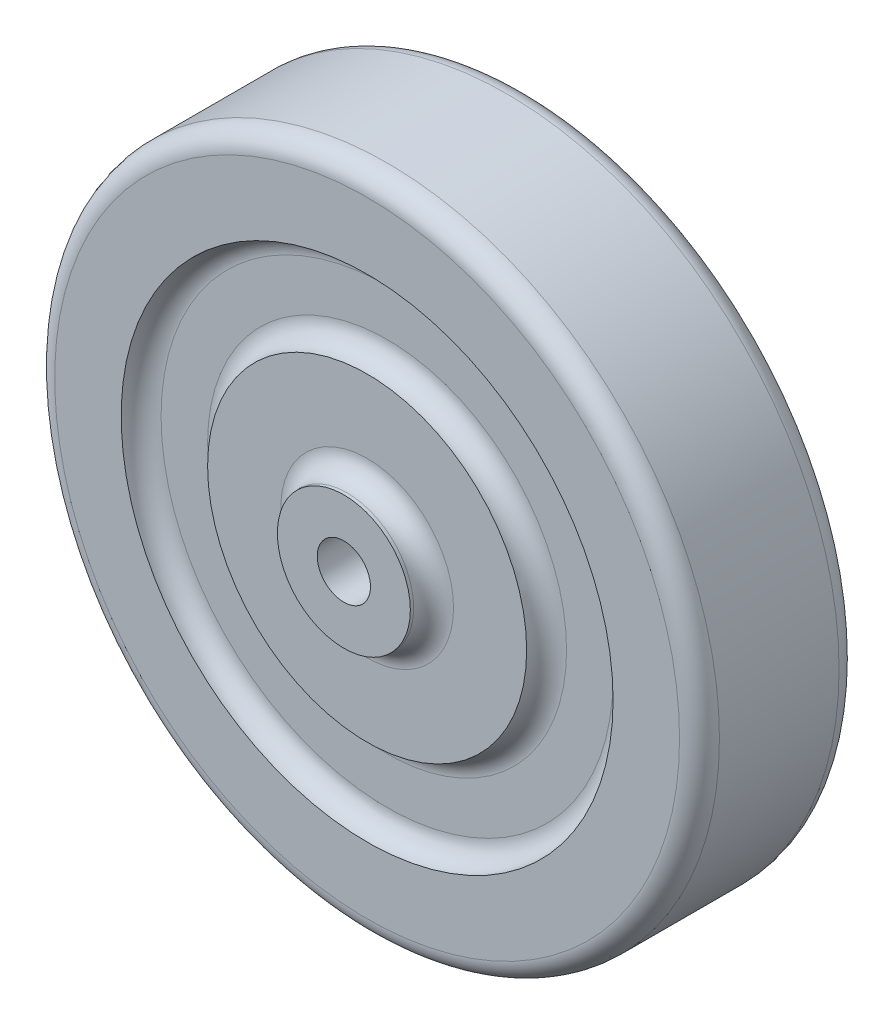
ISO-10303-21;
HEADER;
FILE_DESCRIPTION(('STEP AP214'),'2;1');
FILE_NAME('part.step','',(''),(''),'','','');
FILE_SCHEMA(('AUTOMOTIVE_DESIGN { 1 0 10303 214 1 1 1 1 }'));
ENDSEC;
DATA;
#1=APPLICATION_CONTEXT('core data for automotive mechanical design processes');
#2=APPLICATION_PROTOCOL_DEFINITION('international standard','automotive_design',2000,#1);
#3=PRODUCT_CONTEXT('',#1,'mechanical');
#4=PRODUCT('Part','Part','',(#3));
#5=PRODUCT_RELATED_PRODUCT_CATEGORY('part','',(#4));
#6=PRODUCT_DEFINITION_FORMATION('','',#4);
#7=PRODUCT_DEFINITION_CONTEXT('part definition',#1,'design');
#8=PRODUCT_DEFINITION('design','',#6,#7);
#9=PRODUCT_DEFINITION_SHAPE('','',#8);
#10=(LENGTH_UNIT() NAMED_UNIT(*) SI_UNIT(.MILLI.,.METRE.));
#11=(NAMED_UNIT(*) PLANE_ANGLE_UNIT() SI_UNIT($,.RADIAN.));
#12=(NAMED_UNIT(*) SI_UNIT($,.STERADIAN.) SOLID_ANGLE_UNIT());
#13=UNCERTAINTY_MEASURE_WITH_UNIT(LENGTH_MEASURE(1.E-05),#10,'distance_accuracy_value','');
#14=(GEOMETRIC_REPRESENTATION_CONTEXT(3) GLOBAL_UNCERTAINTY_ASSIGNED_CONTEXT((#13)) GLOBAL_UNIT_ASSIGNED_CONTEXT((#10,
#11,#12)) REPRESENTATION_CONTEXT('',''));
#15=CARTESIAN_POINT('',(0.,0.,0.));
#16=DIRECTION('',(0.,0.,1.));
#17=DIRECTION('',(1.,0.,0.));
#18=AXIS2_PLACEMENT_3D('',#15,#16,#17);
#19=CARTESIAN_POINT('',(0.,0.,-12.));
#20=DIRECTION('',(0.,0.,1.));
#21=DIRECTION('',(1.,0.,0.));
#22=AXIS2_PLACEMENT_3D('',#19,#20,#21);
#23=PLANE('',#22);
#24=CARTESIAN_POINT('',(0.,0.,-12.));
#25=DIRECTION('',(0.,0.,1.));
#26=DIRECTION('',(1.,0.,0.));
#27=AXIS2_PLACEMENT_3D('',#24,#25,#26);
#28=CIRCLE('',#27,13.);
#29=CARTESIAN_POINT('',(13.,0.,-12.));
#30=VERTEX_POINT('',#29);
#31=EDGE_CURVE('E40',#30,#30,#28,.T.);
#32=ORIENTED_EDGE('',*,*,#31,.T.);
#33=EDGE_LOOP('',(#32));
#34=FACE_BOUND('',#33,.T.);
#35=CARTESIAN_POINT('',(0.,0.,-12.));
#36=DIRECTION('',(0.,0.,-1.));
#37=DIRECTION('',(-1.,0.,0.));
#38=AXIS2_PLACEMENT_3D('',#35,#36,#37);
#39=CIRCLE('',#38,24.);
#40=CARTESIAN_POINT('',(-24.,0.,-12.));
#41=VERTEX_POINT('',#40);
#42=EDGE_CURVE('E94',#41,#41,#39,.T.);
#43=ORIENTED_EDGE('',*,*,#42,.T.);
#44=EDGE_LOOP('',(#43));
#45=FACE_BOUND('',#44,.T.);
#46=ADVANCED_FACE('F29',(#34,#45),#23,.F.);
#47=CARTESIAN_POINT('',(0.,0.,12.));
#48=DIRECTION('',(0.,0.,1.));
#49=DIRECTION('',(1.,0.,0.));
#50=AXIS2_PLACEMENT_3D('',#47,#48,#49);
#51=PLANE('',#50);
#52=CARTESIAN_POINT('',(0.,0.,12.));
#53=DIRECTION('',(0.,0.,1.));
#54=DIRECTION('',(1.,0.,0.));
#55=AXIS2_PLACEMENT_3D('',#52,#53,#54);
#56=CIRCLE('',#55,13.);
#57=CARTESIAN_POINT('',(13.,0.,12.));
#58=VERTEX_POINT('',#57);
#59=EDGE_CURVE('E10',#58,#58,#56,.F.);
#60=ORIENTED_EDGE('',*,*,#59,.T.);
#61=EDGE_LOOP('',(#60));
#62=FACE_BOUND('',#61,.T.);
#63=CARTESIAN_POINT('',(0.,0.,12.));
#64=DIRECTION('',(0.,0.,1.));
#65=DIRECTION('',(1.,0.,0.));
#66=AXIS2_PLACEMENT_3D('',#63,#64,#65);
#67=CIRCLE('',#66,24.);
#68=CARTESIAN_POINT('',(24.,0.,12.));
#69=VERTEX_POINT('',#68);
#70=EDGE_CURVE('E88',#69,#69,#67,.T.);
#71=ORIENTED_EDGE('',*,*,#70,.T.);
#72=EDGE_LOOP('',(#71));
#73=FACE_BOUND('',#72,.T.);
#74=ADVANCED_FACE('F115',(#62,#73),#51,.T.);
#75=CARTESIAN_POINT('',(0.,0.,-12.));
#76=DIRECTION('',(0.,0.,1.));
#77=DIRECTION('',(1.,0.,0.));
#78=AXIS2_PLACEMENT_3D('',#75,#76,#77);
#79=CIRCLE('',#78,47.);
#80=CARTESIAN_POINT('',(47.,0.,-12.));
#81=VERTEX_POINT('',#80);
#82=EDGE_CURVE('E61',#81,#81,#79,.F.);
#83=ORIENTED_EDGE('',*,*,#82,.T.);
#84=EDGE_LOOP('',(#83));
#85=FACE_BOUND('',#84,.T.);
#86=CARTESIAN_POINT('',(0.,0.,-12.));
#87=DIRECTION('',(0.,0.,-1.));
#88=DIRECTION('',(-1.,0.,0.));
#89=AXIS2_PLACEMENT_3D('',#86,#87,#88);
#90=CIRCLE('',#89,37.);
#91=CARTESIAN_POINT('',(-37.,0.,-12.));
#92=VERTEX_POINT('',#91);
#93=EDGE_CURVE('E91',#92,#92,#90,.T.);
#94=ORIENTED_EDGE('',*,*,#93,.F.);
#95=EDGE_LOOP('',(#94));
#96=FACE_BOUND('',#95,.T.);
#97=ADVANCED_FACE('F118',(#85,#96),#23,.F.);
#98=CARTESIAN_POINT('',(0.,0.,12.));
#99=DIRECTION('',(0.,0.,1.));
#100=DIRECTION('',(1.,0.,0.));
#101=AXIS2_PLACEMENT_3D('',#98,#99,#100);
#102=CIRCLE('',#101,47.);
#103=CARTESIAN_POINT('',(47.,0.,12.));
#104=VERTEX_POINT('',#103);
#105=EDGE_CURVE('E70',#104,#104,#102,.T.);
#106=ORIENTED_EDGE('',*,*,#105,.T.);
#107=EDGE_LOOP('',(#106));
#108=FACE_BOUND('',#107,.T.);
#109=CARTESIAN_POINT('',(0.,0.,12.));
#110=DIRECTION('',(0.,0.,1.));
#111=DIRECTION('',(1.,0.,0.));
#112=AXIS2_PLACEMENT_3D('',#109,#110,#111);
#113=CIRCLE('',#112,37.);
#114=CARTESIAN_POINT('',(37.,0.,12.));
#115=VERTEX_POINT('',#114);
#116=EDGE_CURVE('E83',#115,#115,#113,.T.);
#117=ORIENTED_EDGE('',*,*,#116,.F.);
#118=EDGE_LOOP('',(#117));
#119=FACE_BOUND('',#118,.T.);
#120=ADVANCED_FACE('F123',(#108,#119),#51,.T.);
#121=CARTESIAN_POINT('',(0.,0.,12.));
#122=DIRECTION('',(0.,0.,-1.));
#123=DIRECTION('',(-1.,0.,0.));
#124=AXIS2_PLACEMENT_3D('',#121,#122,#123);
#125=CYLINDRICAL_SURFACE('',#124,50.);
#126=CARTESIAN_POINT('',(0.,0.,9.));
#127=DIRECTION('',(0.,0.,1.));
#128=DIRECTION('',(1.,0.,0.));
#129=AXIS2_PLACEMENT_3D('',#126,#127,#128);
#130=CIRCLE('',#129,50.);
#131=CARTESIAN_POINT('',(50.,0.,9.));
#132=VERTEX_POINT('',#131);
#133=EDGE_CURVE('E64',#132,#132,#130,.F.);
#134=ORIENTED_EDGE('',*,*,#133,.T.);
#135=EDGE_LOOP('',(#134));
#136=FACE_BOUND('',#135,.T.);
#137=CARTESIAN_POINT('',(0.,0.,-9.));
#138=DIRECTION('',(0.,0.,1.));
#139=DIRECTION('',(1.,0.,0.));
#140=AXIS2_PLACEMENT_3D('',#137,#138,#139);
#141=CIRCLE('',#140,50.);
#142=CARTESIAN_POINT('',(50.,0.,-9.));
#143=VERTEX_POINT('',#142);
#144=EDGE_CURVE('E67',#143,#143,#141,.T.);
#145=ORIENTED_EDGE('',*,*,#144,.T.);
#146=EDGE_LOOP('',(#145));
#147=FACE_BOUND('',#146,.T.);
#148=ADVANCED_FACE('F130',(#136,#147),#125,.T.);
#149=CARTESIAN_POINT('',(0.,0.,15.5));
#150=DIRECTION('',(0.,0.,-1.));
#151=DIRECTION('',(-1.,0.,0.));
#152=AXIS2_PLACEMENT_3D('',#149,#150,#151);
#153=CYLINDRICAL_SURFACE('',#152,10.);
#154=CARTESIAN_POINT('',(0.,0.,15.));
#155=DIRECTION('',(0.,0.,1.));
#156=DIRECTION('',(1.,0.,0.));
#157=AXIS2_PLACEMENT_3D('',#154,#155,#156);
#158=CIRCLE('',#157,10.);
#159=CARTESIAN_POINT('',(10.,0.,15.));
#160=VERTEX_POINT('',#159);
#161=EDGE_CURVE('E36',#160,#160,#158,.T.);
#162=ORIENTED_EDGE('',*,*,#161,.T.);
#163=EDGE_LOOP('',(#162));
#164=FACE_BOUND('',#163,.T.);
#165=CARTESIAN_POINT('',(0.,0.,15.5));
#166=DIRECTION('',(0.,0.,1.));
#167=DIRECTION('',(1.,0.,0.));
#168=AXIS2_PLACEMENT_3D('',#165,#166,#167);
#169=CIRCLE('',#168,10.);
#170=CARTESIAN_POINT('',(10.,0.,15.5));
#171=VERTEX_POINT('',#170);
#172=EDGE_CURVE('E73',#171,#171,#169,.T.);
#173=ORIENTED_EDGE('',*,*,#172,.F.);
#174=EDGE_LOOP('',(#173));
#175=FACE_BOUND('',#174,.T.);
#176=ADVANCED_FACE('F173',(#164,#175),#153,.T.);
#177=CARTESIAN_POINT('',(0.,0.,15.5));
#178=DIRECTION('',(0.,0.,1.));
#179=DIRECTION('',(1.,0.,0.));
#180=AXIS2_PLACEMENT_3D('',#177,#178,#179);
#181=PLANE('',#180);
#182=CARTESIAN_POINT('',(0.,0.,15.5));
#183=DIRECTION('',(0.,0.,1.));
#184=DIRECTION('',(1.,0.,0.));
#185=AXIS2_PLACEMENT_3D('',#182,#183,#184);
#186=CIRCLE('',#185,4.);
#187=CARTESIAN_POINT('',(4.,0.,15.5));
#188=VERTEX_POINT('',#187);
#189=EDGE_CURVE('E80',#188,#188,#186,.T.);
#190=ORIENTED_EDGE('',*,*,#189,.F.);
#191=EDGE_LOOP('',(#190));
#192=FACE_BOUND('',#191,.T.);
#193=ORIENTED_EDGE('',*,*,#172,.T.);
#194=EDGE_LOOP('',(#193));
#195=FACE_BOUND('',#194,.T.);
#196=ADVANCED_FACE('F169',(#192,#195),#181,.T.);
#197=CARTESIAN_POINT('',(0.,0.,-15.5));
#198=DIRECTION('',(0.,0.,1.));
#199=DIRECTION('',(1.,0.,0.));
#200=AXIS2_PLACEMENT_3D('',#197,#198,#199);
#201=CYLINDRICAL_SURFACE('',#200,10.);
#202=CARTESIAN_POINT('',(0.,0.,-15.));
#203=DIRECTION('',(0.,0.,1.));
#204=DIRECTION('',(1.,0.,0.));
#205=AXIS2_PLACEMENT_3D('',#202,#203,#204);
#206=CIRCLE('',#205,10.);
#207=CARTESIAN_POINT('',(10.,0.,-15.));
#208=VERTEX_POINT('',#207);
#209=EDGE_CURVE('E44',#208,#208,#206,.F.);
#210=ORIENTED_EDGE('',*,*,#209,.T.);
#211=EDGE_LOOP('',(#210));
#212=FACE_BOUND('',#211,.T.);
#213=CARTESIAN_POINT('',(0.,0.,-15.5));
#214=DIRECTION('',(0.,0.,-1.));
#215=DIRECTION('',(-1.,0.,0.));
#216=AXIS2_PLACEMENT_3D('',#213,#214,#215);
#217=CIRCLE('',#216,10.);
#218=CARTESIAN_POINT('',(-10.,0.,-15.5));
#219=VERTEX_POINT('',#218);
#220=EDGE_CURVE('E76',#219,#219,#217,.T.);
#221=ORIENTED_EDGE('',*,*,#220,.F.);
#222=EDGE_LOOP('',(#221));
#223=FACE_BOUND('',#222,.T.);
#224=ADVANCED_FACE('F165',(#212,#223),#201,.T.);
#225=CARTESIAN_POINT('',(0.,0.,-15.5));
#226=DIRECTION('',(0.,0.,-1.));
#227=DIRECTION('',(-1.,0.,0.));
#228=AXIS2_PLACEMENT_3D('',#225,#226,#227);
#229=PLANE('',#228);
#230=CARTESIAN_POINT('',(0.,0.,-15.5));
#231=DIRECTION('',(0.,0.,1.));
#232=DIRECTION('',(1.,0.,0.));
#233=AXIS2_PLACEMENT_3D('',#230,#231,#232);
#234=CIRCLE('',#233,4.);
#235=CARTESIAN_POINT('',(4.,0.,-15.5));
#236=VERTEX_POINT('',#235);
#237=EDGE_CURVE('E79',#236,#236,#234,.T.);
#238=ORIENTED_EDGE('',*,*,#237,.T.);
#239=EDGE_LOOP('',(#238));
#240=FACE_BOUND('',#239,.T.);
#241=ORIENTED_EDGE('',*,*,#220,.T.);
#242=EDGE_LOOP('',(#241));
#243=FACE_BOUND('',#242,.T.);
#244=ADVANCED_FACE('F161',(#240,#243),#229,.T.);
#245=CARTESIAN_POINT('',(0.,0.,-15.5));
#246=DIRECTION('',(0.,0.,1.));
#247=DIRECTION('',(1.,0.,0.));
#248=AXIS2_PLACEMENT_3D('',#245,#246,#247);
#249=CYLINDRICAL_SURFACE('',#248,4.);
#250=ORIENTED_EDGE('',*,*,#237,.F.);
#251=EDGE_LOOP('',(#250));
#252=FACE_BOUND('',#251,.T.);
#253=ORIENTED_EDGE('',*,*,#189,.T.);
#254=EDGE_LOOP('',(#253));
#255=FACE_BOUND('',#254,.T.);
#256=ADVANCED_FACE('F155',(#252,#255),#249,.F.);
#257=CARTESIAN_POINT('',(0.,0.,9.));
#258=DIRECTION('',(0.,0.,1.));
#259=DIRECTION('',(1.,0.,0.));
#260=AXIS2_PLACEMENT_3D('',#257,#258,#259);
#261=PLANE('',#260);
#262=CARTESIAN_POINT('',(0.,0.,9.));
#263=DIRECTION('',(0.,0.,1.));
#264=DIRECTION('',(1.,0.,0.));
#265=AXIS2_PLACEMENT_3D('',#262,#263,#264);
#266=CIRCLE('',#265,34.);
#267=CARTESIAN_POINT('',(34.,0.,9.));
#268=VERTEX_POINT('',#267);
#269=EDGE_CURVE('E49',#268,#268,#266,.T.);
#270=ORIENTED_EDGE('',*,*,#269,.T.);
#271=EDGE_LOOP('',(#270));
#272=FACE_BOUND('',#271,.T.);
#273=CARTESIAN_POINT('',(0.,0.,9.));
#274=DIRECTION('',(0.,0.,1.));
#275=DIRECTION('',(1.,0.,0.));
#276=AXIS2_PLACEMENT_3D('',#273,#274,#275);
#277=CIRCLE('',#276,27.);
#278=CARTESIAN_POINT('',(27.,0.,9.));
#279=VERTEX_POINT('',#278);
#280=EDGE_CURVE('E52',#279,#279,#277,.F.);
#281=ORIENTED_EDGE('',*,*,#280,.T.);
#282=EDGE_LOOP('',(#281));
#283=FACE_BOUND('',#282,.T.);
#284=ADVANCED_FACE('F147',(#272,#283),#261,.T.);
#285=CARTESIAN_POINT('',(0.,0.,-9.));
#286=DIRECTION('',(0.,0.,-1.));
#287=DIRECTION('',(-1.,0.,0.));
#288=AXIS2_PLACEMENT_3D('',#285,#286,#287);
#289=PLANE('',#288);
#290=CARTESIAN_POINT('',(0.,0.,-9.));
#291=DIRECTION('',(0.,0.,-1.));
#292=DIRECTION('',(-1.,0.,0.));
#293=AXIS2_PLACEMENT_3D('',#290,#291,#292);
#294=CIRCLE('',#293,34.);
#295=CARTESIAN_POINT('',(-34.,0.,-9.));
#296=VERTEX_POINT('',#295);
#297=EDGE_CURVE('E55',#296,#296,#294,.T.);
#298=ORIENTED_EDGE('',*,*,#297,.T.);
#299=EDGE_LOOP('',(#298));
#300=FACE_BOUND('',#299,.T.);
#301=CARTESIAN_POINT('',(0.,0.,-9.));
#302=DIRECTION('',(0.,0.,-1.));
#303=DIRECTION('',(-1.,0.,0.));
#304=AXIS2_PLACEMENT_3D('',#301,#302,#303);
#305=CIRCLE('',#304,27.);
#306=CARTESIAN_POINT('',(-27.,0.,-9.));
#307=VERTEX_POINT('',#306);
#308=EDGE_CURVE('E58',#307,#307,#305,.F.);
#309=ORIENTED_EDGE('',*,*,#308,.T.);
#310=EDGE_LOOP('',(#309));
#311=FACE_BOUND('',#310,.T.);
#312=ADVANCED_FACE('F143',(#300,#311),#289,.T.);
#313=CARTESIAN_POINT('',(0.,0.,9.));
#314=DIRECTION('',(0.,0.,1.));
#315=DIRECTION('',(1.,0.,0.));
#316=AXIS2_PLACEMENT_3D('',#313,#314,#315);
#317=TOROIDAL_SURFACE('',#316,47.,3.);
#318=ORIENTED_EDGE('',*,*,#133,.F.);
#319=EDGE_LOOP('',(#318));
#320=FACE_BOUND('',#319,.T.);
#321=ORIENTED_EDGE('',*,*,#105,.F.);
#322=EDGE_LOOP('',(#321));
#323=FACE_BOUND('',#322,.T.);
#324=ADVANCED_FACE('F146',(#320,#323),#317,.T.);
#325=CARTESIAN_POINT('',(0.,0.,-9.));
#326=DIRECTION('',(0.,0.,1.));
#327=DIRECTION('',(1.,0.,0.));
#328=AXIS2_PLACEMENT_3D('',#325,#326,#327);
#329=TOROIDAL_SURFACE('',#328,47.,3.);
#330=ORIENTED_EDGE('',*,*,#82,.F.);
#331=EDGE_LOOP('',(#330));
#332=FACE_BOUND('',#331,.T.);
#333=ORIENTED_EDGE('',*,*,#144,.F.);
#334=EDGE_LOOP('',(#333));
#335=FACE_BOUND('',#334,.T.);
#336=ADVANCED_FACE('F139',(#332,#335),#329,.T.);
#337=CARTESIAN_POINT('',(0.,0.,-12.));
#338=DIRECTION('',(0.,0.,-1.));
#339=DIRECTION('',(-1.,0.,0.));
#340=AXIS2_PLACEMENT_3D('',#337,#338,#339);
#341=TOROIDAL_SURFACE('',#340,34.,3.);
#342=ORIENTED_EDGE('',*,*,#93,.T.);
#343=EDGE_LOOP('',(#342));
#344=FACE_BOUND('',#343,.T.);
#345=ORIENTED_EDGE('',*,*,#297,.F.);
#346=EDGE_LOOP('',(#345));
#347=FACE_BOUND('',#346,.T.);
#348=ADVANCED_FACE('F136',(#344,#347),#341,.F.);
#349=CARTESIAN_POINT('',(0.,0.,12.));
#350=DIRECTION('',(0.,0.,1.));
#351=DIRECTION('',(1.,0.,0.));
#352=AXIS2_PLACEMENT_3D('',#349,#350,#351);
#353=TOROIDAL_SURFACE('',#352,34.,3.);
#354=ORIENTED_EDGE('',*,*,#116,.T.);
#355=EDGE_LOOP('',(#354));
#356=FACE_BOUND('',#355,.T.);
#357=ORIENTED_EDGE('',*,*,#269,.F.);
#358=EDGE_LOOP('',(#357));
#359=FACE_BOUND('',#358,.T.);
#360=ADVANCED_FACE('F110',(#356,#359),#353,.F.);
#361=CARTESIAN_POINT('',(0.,0.,12.));
#362=DIRECTION('',(0.,0.,1.));
#363=DIRECTION('',(1.,0.,0.));
#364=AXIS2_PLACEMENT_3D('',#361,#362,#363);
#365=TOROIDAL_SURFACE('',#364,27.,3.);
#366=ORIENTED_EDGE('',*,*,#280,.F.);
#367=EDGE_LOOP('',(#366));
#368=FACE_BOUND('',#367,.T.);
#369=ORIENTED_EDGE('',*,*,#70,.F.);
#370=EDGE_LOOP('',(#369));
#371=FACE_BOUND('',#370,.T.);
#372=ADVANCED_FACE('F102',(#368,#371),#365,.F.);
#373=CARTESIAN_POINT('',(0.,0.,-12.));
#374=DIRECTION('',(0.,0.,-1.));
#375=DIRECTION('',(-1.,0.,0.));
#376=AXIS2_PLACEMENT_3D('',#373,#374,#375);
#377=TOROIDAL_SURFACE('',#376,27.,3.);
#378=ORIENTED_EDGE('',*,*,#308,.F.);
#379=EDGE_LOOP('',(#378));
#380=FACE_BOUND('',#379,.T.);
#381=ORIENTED_EDGE('',*,*,#42,.F.);
#382=EDGE_LOOP('',(#381));
#383=FACE_BOUND('',#382,.T.);
#384=ADVANCED_FACE('F99',(#380,#383),#377,.F.);
#385=CARTESIAN_POINT('',(0.,0.,-15.));
#386=DIRECTION('',(0.,0.,1.));
#387=DIRECTION('',(1.,0.,0.));
#388=AXIS2_PLACEMENT_3D('',#385,#386,#387);
#389=TOROIDAL_SURFACE('',#388,13.,3.);
#390=ORIENTED_EDGE('',*,*,#31,.F.);
#391=EDGE_LOOP('',(#390));
#392=FACE_BOUND('',#391,.T.);
#393=ORIENTED_EDGE('',*,*,#209,.F.);
#394=EDGE_LOOP('',(#393));
#395=FACE_BOUND('',#394,.T.);
#396=ADVANCED_FACE('F101',(#392,#395),#389,.F.);
#397=CARTESIAN_POINT('',(0.,0.,15.));
#398=DIRECTION('',(0.,0.,1.));
#399=DIRECTION('',(1.,0.,0.));
#400=AXIS2_PLACEMENT_3D('',#397,#398,#399);
#401=TOROIDAL_SURFACE('',#400,13.,3.);
#402=ORIENTED_EDGE('',*,*,#59,.F.);
#403=EDGE_LOOP('',(#402));
#404=FACE_BOUND('',#403,.T.);
#405=ORIENTED_EDGE('',*,*,#161,.F.);
#406=EDGE_LOOP('',(#405));
#407=FACE_BOUND('',#406,.T.);
#408=ADVANCED_FACE('F31',(#404,#407),#401,.F.);
#409=CLOSED_SHELL('',(#46,#74,#97,#120,#148,#176,#196,#224,#244,#256,#284,#312,#324,#336,#348,
#360,#372,#384,#396,#408));
#410=MANIFOLD_SOLID_BREP('B2',#409);
#411=ADVANCED_BREP_SHAPE_REPRESENTATION('',(#18,#410),#14);
#412=SHAPE_DEFINITION_REPRESENTATION(#9,#411);
ENDSEC;
END-ISO-10303-21;
